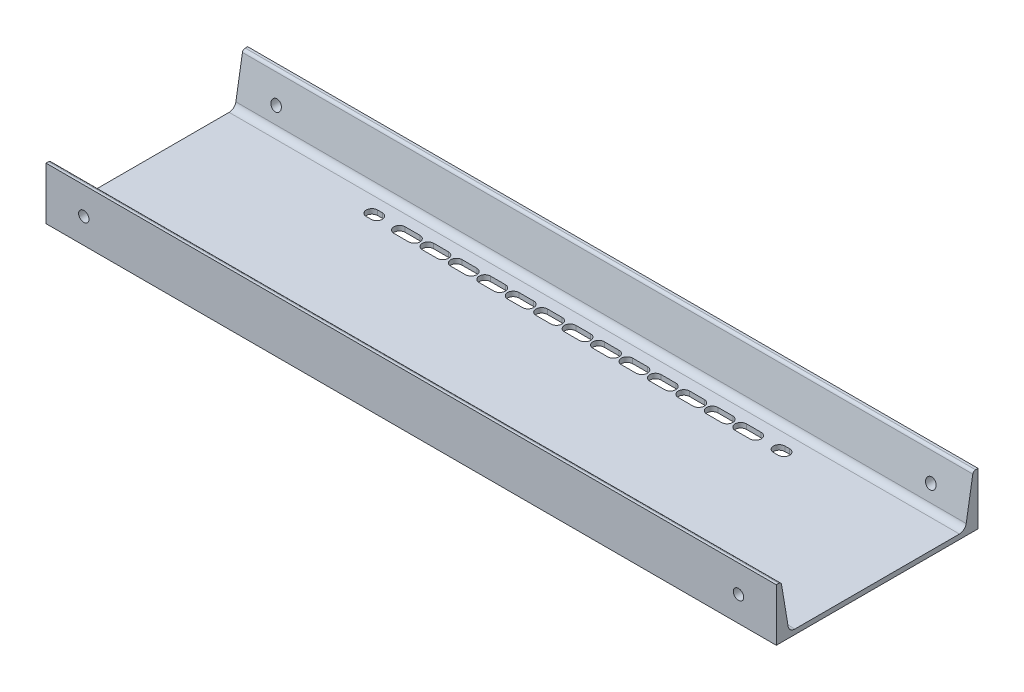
from build123d import *

# Parameters (mm, degrees)
BEAM_E_W_DEPTH         = 459.915
E_W_BOLT_HOLES_DEPTH   = 480.73565803
PIN_HOLES_1_DEPTH      = 480.73565803
PIN_HOLES_1_DEPTH_BACK = 480.73565803
SKETCH3_R              = 6.5484375


with BuildPart() as part:
    # sk C10 x 15.3 → beam E W (new, symmetric)
    with BuildSketch(Plane.YZ):
        with BuildLine():
            Line((-16.08507671, -127), (-16.08507671, 127))
            Line((-16.08507671, 127), (49.95492329, 127))
            Line((49.95492329, 127), (49.95492329, 123.933645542))
            ThreePointArc((49.95492329, 123.933645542), (49.112235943, 121.63515246), (46.983567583, 120.426035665))
            Line((46.983567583, 120.426035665), (-2.772927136, 112.132681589))
            ThreePointArc((-2.772927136, 112.132681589), (-7.942550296, 109.196255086), (-9.98907671, 103.614200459))
            Line((-9.98907671, 103.614200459), (-9.98907671, -103.614200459))
            ThreePointArc((-9.98907671, -103.614200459), (-7.942550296, -109.196255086), (-2.772927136, -112.132681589))
            Line((-2.772927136, -112.132681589), (46.983567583, -120.426035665))
            ThreePointArc((46.983567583, -120.426035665), (49.112235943, -121.63515246), (49.95492329, -123.933645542))
            Line((49.95492329, -123.933645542), (49.95492329, -127))
            Line((49.95492329, -127), (-16.08507671, -127))
        make_face()
    extrude(amount=BEAM_E_W_DEPTH, both=True)

    # sk Bolt Pattern East West → E W bolt holes (cut, through all)
    with BuildSketch(Plane(origin=(0, 0, 0), x_dir=(-1, 0, 0), z_dir=(0, 1, 0))):
        with BuildLine():
            ThreePointArc((-253.921489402, 75.40625), (-246.777739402, 82.55), (-253.921489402, 89.69375))
            Line((-253.921489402, 89.69375), (-259.921489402, 89.69375))
            ThreePointArc((-259.921489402, 89.69375), (-267.065239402, 82.55), (-259.921489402, 75.40625))
            Line((-259.921489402, 75.40625), (-253.921489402, 75.40625))
        make_face()
        with BuildLine():
            Line((253.921489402, 88.727317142), (259.921489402, 88.727317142))
            ThreePointArc((259.921489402, 88.727317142), (267.065239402, 81.583567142), (259.921489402, 74.439817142))
            Line((259.921489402, 74.439817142), (253.921489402, 74.439817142))
            ThreePointArc((253.921489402, 74.439817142), (246.777739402, 81.583567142), (253.921489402, 88.727317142))
        make_face()
        with BuildLine():
            Line((-224.184, 89.69375), (-205.584, 89.69375))
            ThreePointArc((-205.584, 89.69375), (-198.44025, 82.55), (-205.584, 75.40625))
            Line((-205.584, 75.40625), (-224.184, 75.40625))
            ThreePointArc((-224.184, 75.40625), (-231.32775, 82.55), (-224.184, 89.69375))
        make_face()
        with BuildLine():
            Line((-188.37, 89.69375), (-169.77, 89.69375))
            ThreePointArc((-169.77, 89.69375), (-162.62625, 82.55), (-169.77, 75.40625))
            Line((-169.77, 75.40625), (-188.37, 75.40625))
            ThreePointArc((-188.37, 75.40625), (-195.51375, 82.55), (-188.37, 89.69375))
        make_face()
        with BuildLine():
            Line((-152.556, 89.69375), (-133.956, 89.69375))
            ThreePointArc((-133.956, 89.69375), (-126.81225, 82.55), (-133.956, 75.40625))
            Line((-133.956, 75.40625), (-152.556, 75.40625))
            ThreePointArc((-152.556, 75.40625), (-159.69975, 82.55), (-152.556, 89.69375))
        make_face()
        with BuildLine():
            Line((-116.742, 89.69375), (-98.142, 89.69375))
            ThreePointArc((-98.142, 89.69375), (-90.99825, 82.55), (-98.142, 75.40625))
            Line((-98.142, 75.40625), (-116.742, 75.40625))
            ThreePointArc((-116.742, 75.40625), (-123.88575, 82.55), (-116.742, 89.69375))
        make_face()
        with BuildLine():
            Line((-80.928, 89.69375), (-62.328, 89.69375))
            ThreePointArc((-62.328, 89.69375), (-55.18425, 82.55), (-62.328, 75.40625))
            Line((-62.328, 75.40625), (-80.928, 75.40625))
            ThreePointArc((-80.928, 75.40625), (-88.07175, 82.55), (-80.928, 89.69375))
        make_face()
        with BuildLine():
            Line((-45.114, 89.69375), (-26.514, 89.69375))
            ThreePointArc((-26.514, 89.69375), (-19.37025, 82.55), (-26.514, 75.40625))
            Line((-26.514, 75.40625), (-45.114, 75.40625))
            ThreePointArc((-45.114, 75.40625), (-52.25775, 82.55), (-45.114, 89.69375))
        make_face()
        with BuildLine():
            Line((-9.3, 89.69375), (9.3, 89.69375))
            ThreePointArc((9.3, 89.69375), (16.44375, 82.55), (9.3, 75.40625))
            Line((9.3, 75.40625), (-9.3, 75.40625))
            ThreePointArc((-9.3, 75.40625), (-16.44375, 82.55), (-9.3, 89.69375))
        make_face()
        with BuildLine():
            Line((26.514, 89.69375), (45.114, 89.69375))
            ThreePointArc((45.114, 89.69375), (52.25775, 82.55), (45.114, 75.40625))
            Line((45.114, 75.40625), (26.514, 75.40625))
            ThreePointArc((26.514, 75.40625), (19.37025, 82.55), (26.514, 89.69375))
        make_face()
        with BuildLine():
            Line((62.328, 89.69375), (80.928, 89.69375))
            ThreePointArc((80.928, 89.69375), (88.07175, 82.55), (80.928, 75.40625))
            Line((80.928, 75.40625), (62.328, 75.40625))
            ThreePointArc((62.328, 75.40625), (55.18425, 82.55), (62.328, 89.69375))
        make_face()
        with BuildLine():
            Line((98.142, 89.69375), (116.742, 89.69375))
            ThreePointArc((116.742, 89.69375), (123.88575, 82.55), (116.742, 75.40625))
            Line((116.742, 75.40625), (98.142, 75.40625))
            ThreePointArc((98.142, 75.40625), (90.99825, 82.55), (98.142, 89.69375))
        make_face()
        with BuildLine():
            Line((133.956, 89.69375), (152.556, 89.69375))
            ThreePointArc((152.556, 89.69375), (159.69975, 82.55), (152.556, 75.40625))
            Line((152.556, 75.40625), (133.956, 75.40625))
            ThreePointArc((133.956, 75.40625), (126.81225, 82.55), (133.956, 89.69375))
        make_face()
        with BuildLine():
            Line((169.77, 89.69375), (188.37, 89.69375))
            ThreePointArc((188.37, 89.69375), (195.51375, 82.55), (188.37, 75.40625))
            Line((188.37, 75.40625), (169.77, 75.40625))
            ThreePointArc((169.77, 75.40625), (162.62625, 82.55), (169.77, 89.69375))
        make_face()
        with BuildLine():
            Line((205.584, 89.69375), (224.184, 89.69375))
            ThreePointArc((224.184, 89.69375), (231.32775, 82.55), (224.184, 75.40625))
            Line((224.184, 75.40625), (205.584, 75.40625))
            ThreePointArc((205.584, 75.40625), (198.44025, 82.55), (205.584, 89.69375))
        make_face()
        with BuildLine():
            ThreePointArc((-253.921489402, -89.69375), (-246.777739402, -82.55), (-253.921489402, -75.40625))
            Line((-253.921489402, -75.40625), (-259.921489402, -75.40625))
            ThreePointArc((-259.921489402, -75.40625), (-267.065239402, -82.55), (-259.921489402, -89.69375))
            Line((-259.921489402, -89.69375), (-253.921489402, -89.69375))
        make_face()
        with BuildLine():
            Line((253.921489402, -76.372682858), (259.921489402, -76.372682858))
            ThreePointArc((259.921489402, -76.372682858), (267.065239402, -83.516432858), (259.921489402, -90.660182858))
            Line((259.921489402, -90.660182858), (253.921489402, -90.660182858))
            ThreePointArc((253.921489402, -90.660182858), (246.777739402, -83.516432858), (253.921489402, -76.372682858))
        make_face()
        with BuildLine():
            Line((-224.184, -75.40625), (-205.584, -75.40625))
            ThreePointArc((-205.584, -75.40625), (-198.44025, -82.55), (-205.584, -89.69375))
            Line((-205.584, -89.69375), (-224.184, -89.69375))
            ThreePointArc((-224.184, -89.69375), (-231.32775, -82.55), (-224.184, -75.40625))
        make_face()
        with BuildLine():
            Line((-188.37, -75.40625), (-169.77, -75.40625))
            ThreePointArc((-169.77, -75.40625), (-162.62625, -82.55), (-169.77, -89.69375))
            Line((-169.77, -89.69375), (-188.37, -89.69375))
            ThreePointArc((-188.37, -89.69375), (-195.51375, -82.55), (-188.37, -75.40625))
        make_face()
        with BuildLine():
            Line((-152.556, -75.40625), (-133.956, -75.40625))
            ThreePointArc((-133.956, -75.40625), (-126.81225, -82.55), (-133.956, -89.69375))
            Line((-133.956, -89.69375), (-152.556, -89.69375))
            ThreePointArc((-152.556, -89.69375), (-159.69975, -82.55), (-152.556, -75.40625))
        make_face()
        with BuildLine():
            Line((-116.742, -75.40625), (-98.142, -75.40625))
            ThreePointArc((-98.142, -75.40625), (-90.99825, -82.55), (-98.142, -89.69375))
            Line((-98.142, -89.69375), (-116.742, -89.69375))
            ThreePointArc((-116.742, -89.69375), (-123.88575, -82.55), (-116.742, -75.40625))
        make_face()
        with BuildLine():
            Line((-80.928, -75.40625), (-62.328, -75.40625))
            ThreePointArc((-62.328, -75.40625), (-55.18425, -82.55), (-62.328, -89.69375))
            Line((-62.328, -89.69375), (-80.928, -89.69375))
            ThreePointArc((-80.928, -89.69375), (-88.07175, -82.55), (-80.928, -75.40625))
        make_face()
        with BuildLine():
            Line((-45.114, -75.40625), (-26.514, -75.40625))
            ThreePointArc((-26.514, -75.40625), (-19.37025, -82.55), (-26.514, -89.69375))
            Line((-26.514, -89.69375), (-45.114, -89.69375))
            ThreePointArc((-45.114, -89.69375), (-52.25775, -82.55), (-45.114, -75.40625))
        make_face()
        with BuildLine():
            Line((-9.3, -75.40625), (9.3, -75.40625))
            ThreePointArc((9.3, -75.40625), (16.44375, -82.55), (9.3, -89.69375))
            Line((9.3, -89.69375), (-9.3, -89.69375))
            ThreePointArc((-9.3, -89.69375), (-16.44375, -82.55), (-9.3, -75.40625))
        make_face()
        with BuildLine():
            Line((26.514, -75.40625), (45.114, -75.40625))
            ThreePointArc((45.114, -75.40625), (52.25775, -82.55), (45.114, -89.69375))
            Line((45.114, -89.69375), (26.514, -89.69375))
            ThreePointArc((26.514, -89.69375), (19.37025, -82.55), (26.514, -75.40625))
        make_face()
        with BuildLine():
            Line((62.328, -75.40625), (80.928, -75.40625))
            ThreePointArc((80.928, -75.40625), (88.07175, -82.55), (80.928, -89.69375))
            Line((80.928, -89.69375), (62.328, -89.69375))
            ThreePointArc((62.328, -89.69375), (55.18425, -82.55), (62.328, -75.40625))
        make_face()
        with BuildLine():
            Line((98.142, -75.40625), (116.742, -75.40625))
            ThreePointArc((116.742, -75.40625), (123.88575, -82.55), (116.742, -89.69375))
            Line((116.742, -89.69375), (98.142, -89.69375))
            ThreePointArc((98.142, -89.69375), (90.99825, -82.55), (98.142, -75.40625))
        make_face()
        with BuildLine():
            Line((133.956, -75.40625), (152.556, -75.40625))
            ThreePointArc((152.556, -75.40625), (159.69975, -82.55), (152.556, -89.69375))
            Line((152.556, -89.69375), (133.956, -89.69375))
            ThreePointArc((133.956, -89.69375), (126.81225, -82.55), (133.956, -75.40625))
        make_face()
        with BuildLine():
            Line((169.77, -75.40625), (188.37, -75.40625))
            ThreePointArc((188.37, -75.40625), (195.51375, -82.55), (188.37, -89.69375))
            Line((188.37, -89.69375), (169.77, -89.69375))
            ThreePointArc((169.77, -89.69375), (162.62625, -82.55), (169.77, -75.40625))
        make_face()
        with BuildLine():
            Line((205.584, -75.40625), (224.184, -75.40625))
            ThreePointArc((224.184, -75.40625), (231.32775, -82.55), (224.184, -89.69375))
            Line((224.184, -89.69375), (205.584, -89.69375))
            ThreePointArc((205.584, -89.69375), (198.44025, -82.55), (205.584, -75.40625))
        make_face()
    extrude(amount=-E_W_BOLT_HOLES_DEPTH, mode=Mode.SUBTRACT)

    # Sketch3 → Pin holes 1 (cut, two sides: drawn at the far end of the back side and taken through both)
    with BuildSketch(Plane(origin=(0, 0, 0), x_dir=(0, 1, 0), z_dir=(0, 0, 1)).offset(-PIN_HOLES_1_DEPTH_BACK)):
        with Locations(Location((15.66492329, 412.29, 0), (0, 0, 270))):
            Circle(SKETCH3_R)
        with Locations(Location((15.66492329, -412.29, 0), (0, 0, 270))):
            Circle(SKETCH3_R)
    extrude(amount=PIN_HOLES_1_DEPTH + PIN_HOLES_1_DEPTH_BACK, mode=Mode.SUBTRACT)


solid = part.part
